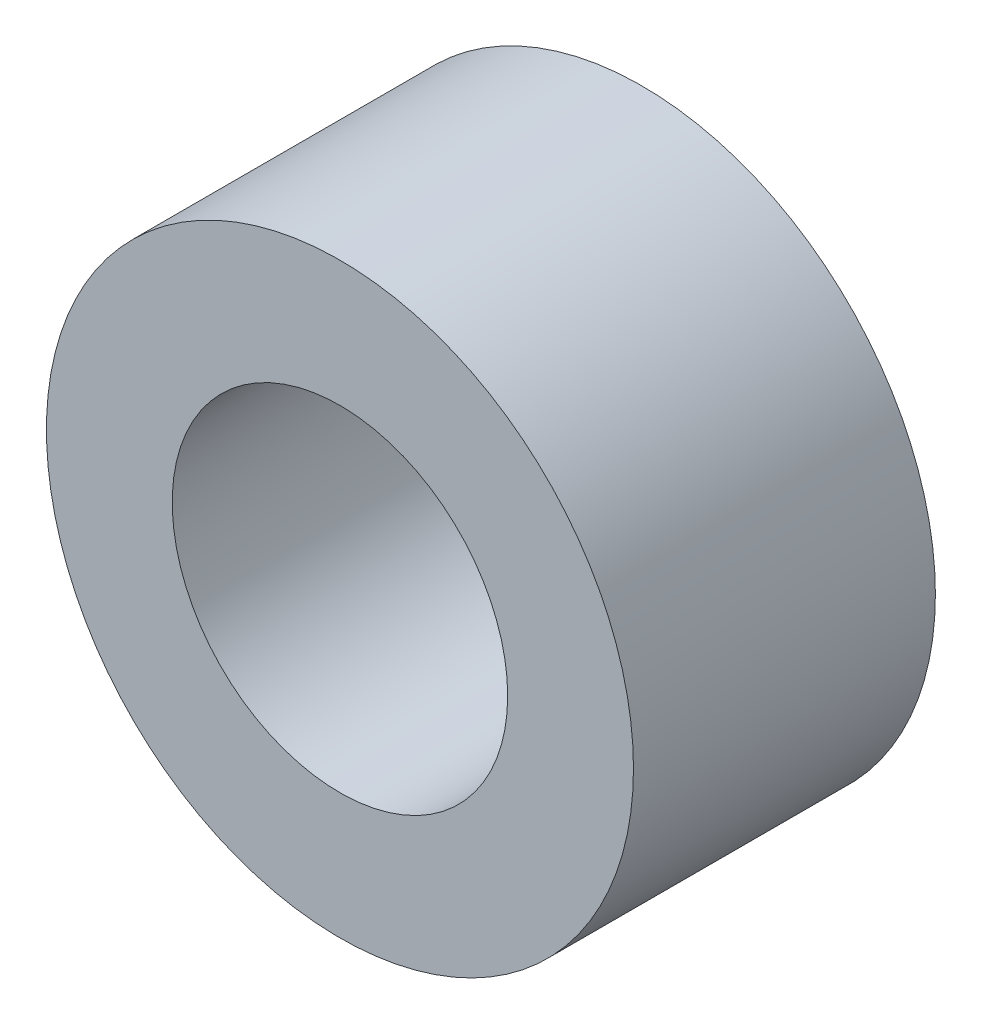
ISO-10303-21;
HEADER;
FILE_DESCRIPTION(('STEP AP214'),'2;1');
FILE_NAME('part.step','',(''),(''),'','','');
FILE_SCHEMA(('AUTOMOTIVE_DESIGN { 1 0 10303 214 1 1 1 1 }'));
ENDSEC;
DATA;
#1=APPLICATION_CONTEXT('core data for automotive mechanical design processes');
#2=APPLICATION_PROTOCOL_DEFINITION('international standard','automotive_design',2000,#1);
#3=PRODUCT_CONTEXT('',#1,'mechanical');
#4=PRODUCT('Part','Part','',(#3));
#5=PRODUCT_RELATED_PRODUCT_CATEGORY('part','',(#4));
#6=PRODUCT_DEFINITION_FORMATION('','',#4);
#7=PRODUCT_DEFINITION_CONTEXT('part definition',#1,'design');
#8=PRODUCT_DEFINITION('design','',#6,#7);
#9=PRODUCT_DEFINITION_SHAPE('','',#8);
#10=(LENGTH_UNIT() NAMED_UNIT(*) SI_UNIT(.MILLI.,.METRE.));
#11=(NAMED_UNIT(*) PLANE_ANGLE_UNIT() SI_UNIT($,.RADIAN.));
#12=(NAMED_UNIT(*) SI_UNIT($,.STERADIAN.) SOLID_ANGLE_UNIT());
#13=UNCERTAINTY_MEASURE_WITH_UNIT(LENGTH_MEASURE(1.E-05),#10,'distance_accuracy_value','');
#14=(GEOMETRIC_REPRESENTATION_CONTEXT(3) GLOBAL_UNCERTAINTY_ASSIGNED_CONTEXT((#13)) GLOBAL_UNIT_ASSIGNED_CONTEXT((#10,
#11,#12)) REPRESENTATION_CONTEXT('',''));
#15=CARTESIAN_POINT('',(0.,0.,0.));
#16=DIRECTION('',(0.,0.,1.));
#17=DIRECTION('',(1.,0.,0.));
#18=AXIS2_PLACEMENT_3D('',#15,#16,#17);
#19=CARTESIAN_POINT('',(0.,0.,1.8));
#20=DIRECTION('',(0.,0.,1.));
#21=DIRECTION('',(1.,0.,0.));
#22=AXIS2_PLACEMENT_3D('',#19,#20,#21);
#23=PLANE('',#22);
#24=CARTESIAN_POINT('',(0.,0.,1.8));
#25=DIRECTION('',(0.,0.,1.));
#26=DIRECTION('',(1.,0.,0.));
#27=AXIS2_PLACEMENT_3D('',#24,#25,#26);
#28=CIRCLE('',#27,1.75);
#29=CARTESIAN_POINT('',(1.75,0.,1.8));
#30=VERTEX_POINT('',#29);
#31=EDGE_CURVE('E10',#30,#30,#28,.T.);
#32=ORIENTED_EDGE('',*,*,#31,.T.);
#33=EDGE_LOOP('',(#32));
#34=FACE_BOUND('',#33,.T.);
#35=CARTESIAN_POINT('',(0.,0.,1.8));
#36=DIRECTION('',(0.,0.,1.));
#37=DIRECTION('',(1.,0.,0.));
#38=AXIS2_PLACEMENT_3D('',#35,#36,#37);
#39=CIRCLE('',#38,1.);
#40=CARTESIAN_POINT('',(1.,0.,1.8));
#41=VERTEX_POINT('',#40);
#42=EDGE_CURVE('E41',#41,#41,#39,.T.);
#43=ORIENTED_EDGE('',*,*,#42,.F.);
#44=EDGE_LOOP('',(#43));
#45=FACE_BOUND('',#44,.T.);
#46=ADVANCED_FACE('F30',(#34,#45),#23,.T.);
#47=CARTESIAN_POINT('',(0.,0.,0.));
#48=DIRECTION('',(0.,0.,1.));
#49=DIRECTION('',(1.,0.,0.));
#50=AXIS2_PLACEMENT_3D('',#47,#48,#49);
#51=PLANE('',#50);
#52=CARTESIAN_POINT('',(0.,0.,0.));
#53=DIRECTION('',(0.,0.,1.));
#54=DIRECTION('',(1.,0.,0.));
#55=AXIS2_PLACEMENT_3D('',#52,#53,#54);
#56=CIRCLE('',#55,1.75);
#57=CARTESIAN_POINT('',(1.75,0.,0.));
#58=VERTEX_POINT('',#57);
#59=EDGE_CURVE('E34',#58,#58,#56,.T.);
#60=ORIENTED_EDGE('',*,*,#59,.F.);
#61=EDGE_LOOP('',(#60));
#62=FACE_BOUND('',#61,.T.);
#63=CARTESIAN_POINT('',(0.,0.,0.));
#64=DIRECTION('',(0.,0.,1.));
#65=DIRECTION('',(1.,0.,0.));
#66=AXIS2_PLACEMENT_3D('',#63,#64,#65);
#67=CIRCLE('',#66,1.);
#68=CARTESIAN_POINT('',(1.,0.,0.));
#69=VERTEX_POINT('',#68);
#70=EDGE_CURVE('E43',#69,#69,#67,.T.);
#71=ORIENTED_EDGE('',*,*,#70,.T.);
#72=EDGE_LOOP('',(#71));
#73=FACE_BOUND('',#72,.T.);
#74=ADVANCED_FACE('F53',(#62,#73),#51,.F.);
#75=CARTESIAN_POINT('',(0.,0.,1.8));
#76=DIRECTION('',(0.,0.,-1.));
#77=DIRECTION('',(-1.,0.,0.));
#78=AXIS2_PLACEMENT_3D('',#75,#76,#77);
#79=CYLINDRICAL_SURFACE('',#78,1.75);
#80=ORIENTED_EDGE('',*,*,#31,.F.);
#81=EDGE_LOOP('',(#80));
#82=FACE_BOUND('',#81,.T.);
#83=ORIENTED_EDGE('',*,*,#59,.T.);
#84=EDGE_LOOP('',(#83));
#85=FACE_BOUND('',#84,.T.);
#86=ADVANCED_FACE('F32',(#82,#85),#79,.T.);
#87=CARTESIAN_POINT('',(0.,0.,1.8));
#88=DIRECTION('',(0.,0.,-1.));
#89=DIRECTION('',(-1.,0.,0.));
#90=AXIS2_PLACEMENT_3D('',#87,#88,#89);
#91=CYLINDRICAL_SURFACE('',#90,1.);
#92=ORIENTED_EDGE('',*,*,#42,.T.);
#93=EDGE_LOOP('',(#92));
#94=FACE_BOUND('',#93,.T.);
#95=ORIENTED_EDGE('',*,*,#70,.F.);
#96=EDGE_LOOP('',(#95));
#97=FACE_BOUND('',#96,.T.);
#98=ADVANCED_FACE('F49',(#94,#97),#91,.F.);
#99=CLOSED_SHELL('',(#46,#74,#86,#98));
#100=MANIFOLD_SOLID_BREP('B2',#99);
#101=ADVANCED_BREP_SHAPE_REPRESENTATION('',(#18,#100),#14);
#102=SHAPE_DEFINITION_REPRESENTATION(#9,#101);
ENDSEC;
END-ISO-10303-21;
